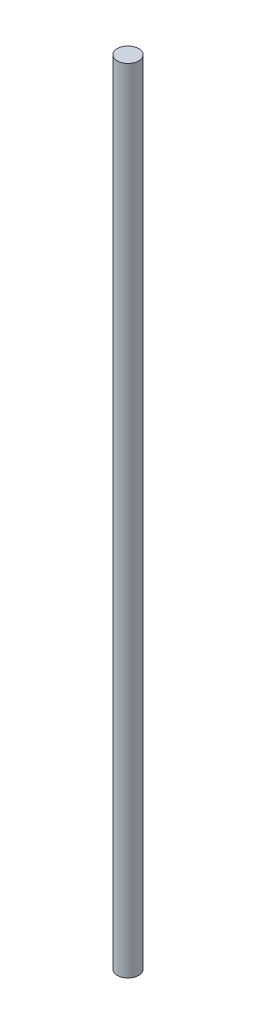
from build123d import *

# Parameters (mm, degrees)
ESQUISSE1_R      = 3.25
EXTRUSION1_DEPTH = 240


with BuildPart() as part:
    # Esquisse1 → Extrusion1 (new body)
    with BuildSketch(Plane(origin=(0, 0, 0), x_dir=(1, 0, 0), z_dir=(0, 1, 0))):
        with Locations(Location((0, 0, 0), (0, 0, 270))):
            Circle(ESQUISSE1_R)
    extrude(amount=EXTRUSION1_DEPTH)


solid = part.part
